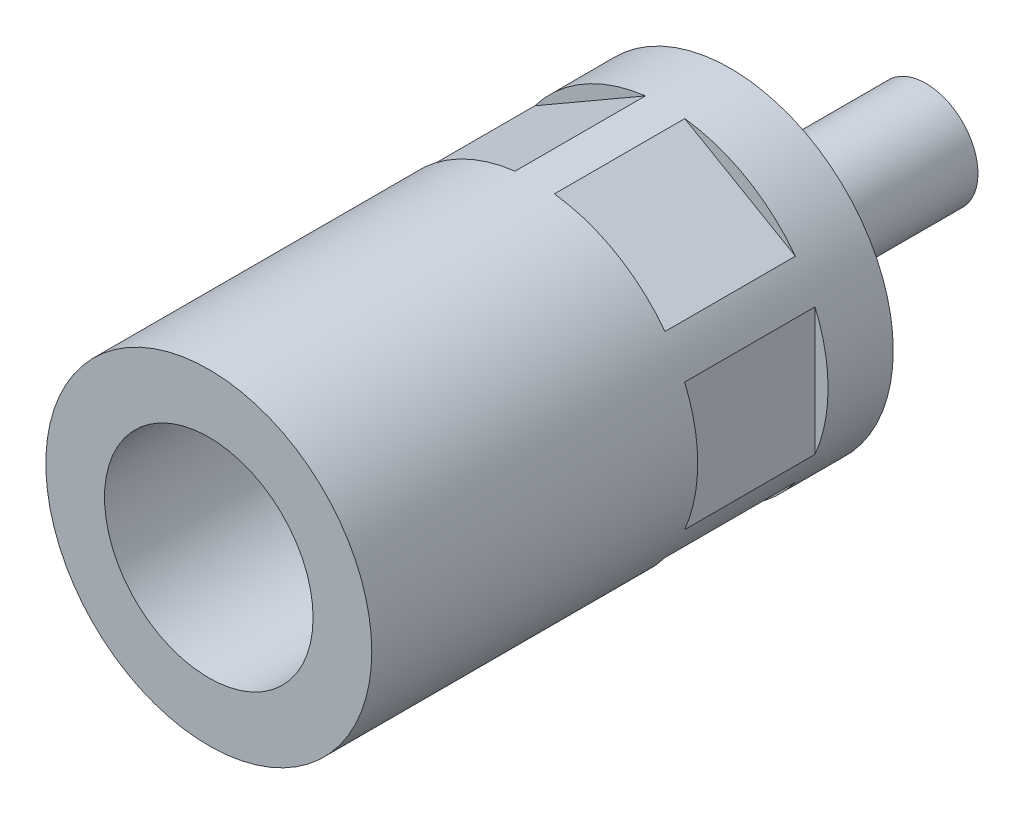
ISO-10303-21;
HEADER;
FILE_DESCRIPTION(('STEP AP214'),'2;1');
FILE_NAME('part.step','',(''),(''),'','','');
FILE_SCHEMA(('AUTOMOTIVE_DESIGN { 1 0 10303 214 1 1 1 1 }'));
ENDSEC;
DATA;
#1=APPLICATION_CONTEXT('core data for automotive mechanical design processes');
#2=APPLICATION_PROTOCOL_DEFINITION('international standard','automotive_design',2000,#1);
#3=PRODUCT_CONTEXT('',#1,'mechanical');
#4=PRODUCT('Part','Part','',(#3));
#5=PRODUCT_RELATED_PRODUCT_CATEGORY('part','',(#4));
#6=PRODUCT_DEFINITION_FORMATION('','',#4);
#7=PRODUCT_DEFINITION_CONTEXT('part definition',#1,'design');
#8=PRODUCT_DEFINITION('design','',#6,#7);
#9=PRODUCT_DEFINITION_SHAPE('','',#8);
#10=(LENGTH_UNIT() NAMED_UNIT(*) SI_UNIT(.MILLI.,.METRE.));
#11=(NAMED_UNIT(*) PLANE_ANGLE_UNIT() SI_UNIT($,.RADIAN.));
#12=(NAMED_UNIT(*) SI_UNIT($,.STERADIAN.) SOLID_ANGLE_UNIT());
#13=UNCERTAINTY_MEASURE_WITH_UNIT(LENGTH_MEASURE(1.E-05),#10,'distance_accuracy_value','');
#14=(GEOMETRIC_REPRESENTATION_CONTEXT(3) GLOBAL_UNCERTAINTY_ASSIGNED_CONTEXT((#13)) GLOBAL_UNIT_ASSIGNED_CONTEXT((#10,
#11,#12)) REPRESENTATION_CONTEXT('',''));
#15=CARTESIAN_POINT('',(0.,0.,0.));
#16=DIRECTION('',(0.,0.,1.));
#17=DIRECTION('',(1.,0.,0.));
#18=AXIS2_PLACEMENT_3D('',#15,#16,#17);
#19=CARTESIAN_POINT('',(0.,0.,80.));
#20=DIRECTION('',(0.,0.,1.));
#21=DIRECTION('',(1.,0.,0.));
#22=AXIS2_PLACEMENT_3D('',#19,#20,#21);
#23=CYLINDRICAL_SURFACE('',#22,25.);
#24=CARTESIAN_POINT('',(0.,0.,10.));
#25=DIRECTION('',(0.,0.,1.));
#26=DIRECTION('',(1.,0.,0.));
#27=AXIS2_PLACEMENT_3D('',#24,#25,#26);
#28=CIRCLE('',#27,25.);
#29=CARTESIAN_POINT('',(-19.9852813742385,-15.0196048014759,10.));
#30=VERTEX_POINT('',#29);
#31=CARTESIAN_POINT('',(-3.01471862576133,-24.8175637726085,10.));
#32=VERTEX_POINT('',#31);
#33=EDGE_CURVE('E153',#30,#32,#28,.T.);
#34=ORIENTED_EDGE('',*,*,#33,.F.);
#35=DIRECTION('',(0.,0.,1.));
#36=VECTOR('',#35,1.);
#37=CARTESIAN_POINT('',(-19.9852813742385,-15.0196048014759,80.));
#38=LINE('',#37,#36);
#39=CARTESIAN_POINT('',(-19.9852813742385,-15.0196048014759,30.));
#40=VERTEX_POINT('',#39);
#41=EDGE_CURVE('E9',#30,#40,#38,.T.);
#42=ORIENTED_EDGE('',*,*,#41,.T.);
#43=CARTESIAN_POINT('',(0.,0.,30.));
#44=DIRECTION('',(0.,0.,1.));
#45=DIRECTION('',(1.,0.,0.));
#46=AXIS2_PLACEMENT_3D('',#43,#44,#45);
#47=CIRCLE('',#46,25.);
#48=CARTESIAN_POINT('',(-3.01471862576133,-24.8175637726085,30.));
#49=VERTEX_POINT('',#48);
#50=EDGE_CURVE('E22',#40,#49,#47,.T.);
#51=ORIENTED_EDGE('',*,*,#50,.T.);
#52=DIRECTION('',(0.,0.,1.));
#53=VECTOR('',#52,1.);
#54=CARTESIAN_POINT('',(-3.01471862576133,-24.8175637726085,80.));
#55=LINE('',#54,#53);
#56=EDGE_CURVE('E150',#49,#32,#55,.F.);
#57=ORIENTED_EDGE('',*,*,#56,.T.);
#58=EDGE_LOOP('',(#34,#42,#51,#57));
#59=FACE_BOUND('',#58,.T.);
#60=DIRECTION('',(0.,0.,1.));
#61=VECTOR('',#60,1.);
#62=CARTESIAN_POINT('',(23.,9.79795897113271,80.));
#63=LINE('',#62,#61);
#64=CARTESIAN_POINT('',(23.,9.79795897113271,10.));
#65=VERTEX_POINT('',#64);
#66=CARTESIAN_POINT('',(23.,9.79795897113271,30.));
#67=VERTEX_POINT('',#66);
#68=EDGE_CURVE('E143',#65,#67,#63,.T.);
#69=ORIENTED_EDGE('',*,*,#68,.F.);
#70=CARTESIAN_POINT('',(23.,-9.79795897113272,10.));
#71=VERTEX_POINT('',#70);
#72=EDGE_CURVE('E142',#71,#65,#28,.T.);
#73=ORIENTED_EDGE('',*,*,#72,.F.);
#74=DIRECTION('',(0.,0.,1.));
#75=VECTOR('',#74,1.);
#76=CARTESIAN_POINT('',(23.,-9.79795897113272,80.));
#77=LINE('',#76,#75);
#78=CARTESIAN_POINT('',(23.,-9.79795897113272,30.));
#79=VERTEX_POINT('',#78);
#80=EDGE_CURVE('E139',#79,#71,#77,.F.);
#81=ORIENTED_EDGE('',*,*,#80,.F.);
#82=EDGE_CURVE('E146',#79,#67,#47,.T.);
#83=ORIENTED_EDGE('',*,*,#82,.T.);
#84=EDGE_LOOP('',(#69,#73,#81,#83));
#85=FACE_BOUND('',#84,.T.);
#86=CARTESIAN_POINT('',(19.9852813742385,15.0196048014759,10.));
#87=VERTEX_POINT('',#86);
#88=CARTESIAN_POINT('',(3.01471862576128,24.8175637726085,10.));
#89=VERTEX_POINT('',#88);
#90=EDGE_CURVE('E135',#87,#89,#28,.T.);
#91=ORIENTED_EDGE('',*,*,#90,.F.);
#92=DIRECTION('',(0.,0.,1.));
#93=VECTOR('',#92,1.);
#94=CARTESIAN_POINT('',(19.9852813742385,15.0196048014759,80.));
#95=LINE('',#94,#93);
#96=CARTESIAN_POINT('',(19.9852813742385,15.0196048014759,30.));
#97=VERTEX_POINT('',#96);
#98=EDGE_CURVE('E136',#87,#97,#95,.T.);
#99=ORIENTED_EDGE('',*,*,#98,.T.);
#100=CARTESIAN_POINT('',(3.01471862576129,24.8175637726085,30.));
#101=VERTEX_POINT('',#100);
#102=EDGE_CURVE('E140',#97,#101,#47,.T.);
#103=ORIENTED_EDGE('',*,*,#102,.T.);
#104=DIRECTION('',(0.,0.,1.));
#105=VECTOR('',#104,1.);
#106=CARTESIAN_POINT('',(3.01471862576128,24.8175637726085,80.));
#107=LINE('',#106,#105);
#108=EDGE_CURVE('E132',#101,#89,#107,.F.);
#109=ORIENTED_EDGE('',*,*,#108,.T.);
#110=EDGE_LOOP('',(#91,#99,#103,#109));
#111=FACE_BOUND('',#110,.T.);
#112=CARTESIAN_POINT('',(0.,0.,0.));
#113=DIRECTION('',(0.,0.,1.));
#114=DIRECTION('',(1.,0.,0.));
#115=AXIS2_PLACEMENT_3D('',#112,#113,#114);
#116=CIRCLE('',#115,25.);
#117=CARTESIAN_POINT('',(25.,0.,0.));
#118=VERTEX_POINT('',#117);
#119=EDGE_CURVE('E202',#118,#118,#116,.T.);
#120=ORIENTED_EDGE('',*,*,#119,.T.);
#121=EDGE_LOOP('',(#120));
#122=FACE_BOUND('',#121,.T.);
#123=CARTESIAN_POINT('',(0.,0.,80.));
#124=DIRECTION('',(0.,0.,1.));
#125=DIRECTION('',(1.,0.,0.));
#126=AXIS2_PLACEMENT_3D('',#123,#124,#125);
#127=CIRCLE('',#126,25.);
#128=CARTESIAN_POINT('',(25.,0.,80.));
#129=VERTEX_POINT('',#128);
#130=EDGE_CURVE('E205',#129,#129,#127,.T.);
#131=ORIENTED_EDGE('',*,*,#130,.F.);
#132=EDGE_LOOP('',(#131));
#133=FACE_BOUND('',#132,.T.);
#134=CARTESIAN_POINT('',(-23.,9.79795897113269,10.));
#135=VERTEX_POINT('',#134);
#136=CARTESIAN_POINT('',(-23.,-9.79795897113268,10.));
#137=VERTEX_POINT('',#136);
#138=EDGE_CURVE('E111',#135,#137,#28,.T.);
#139=ORIENTED_EDGE('',*,*,#138,.F.);
#140=DIRECTION('',(0.,0.,1.));
#141=VECTOR('',#140,1.);
#142=CARTESIAN_POINT('',(-23.,9.79795897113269,80.));
#143=LINE('',#142,#141);
#144=CARTESIAN_POINT('',(-23.,9.79795897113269,30.));
#145=VERTEX_POINT('',#144);
#146=EDGE_CURVE('E110',#135,#145,#143,.T.);
#147=ORIENTED_EDGE('',*,*,#146,.T.);
#148=CARTESIAN_POINT('',(-23.,-9.79795897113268,30.));
#149=VERTEX_POINT('',#148);
#150=EDGE_CURVE('E103',#145,#149,#47,.T.);
#151=ORIENTED_EDGE('',*,*,#150,.T.);
#152=DIRECTION('',(0.,0.,1.));
#153=VECTOR('',#152,1.);
#154=CARTESIAN_POINT('',(-23.,-9.79795897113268,80.));
#155=LINE('',#154,#153);
#156=EDGE_CURVE('E117',#149,#137,#155,.F.);
#157=ORIENTED_EDGE('',*,*,#156,.T.);
#158=EDGE_LOOP('',(#139,#147,#151,#157));
#159=FACE_BOUND('',#158,.T.);
#160=DIRECTION('',(0.,0.,1.));
#161=VECTOR('',#160,1.);
#162=CARTESIAN_POINT('',(-19.9852813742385,15.0196048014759,80.));
#163=LINE('',#162,#161);
#164=CARTESIAN_POINT('',(-19.9852813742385,15.0196048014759,10.));
#165=VERTEX_POINT('',#164);
#166=CARTESIAN_POINT('',(-19.9852813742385,15.0196048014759,30.));
#167=VERTEX_POINT('',#166);
#168=EDGE_CURVE('E130',#165,#167,#163,.T.);
#169=ORIENTED_EDGE('',*,*,#168,.F.);
#170=CARTESIAN_POINT('',(-3.0147186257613,24.8175637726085,10.));
#171=VERTEX_POINT('',#170);
#172=EDGE_CURVE('E126',#171,#165,#28,.T.);
#173=ORIENTED_EDGE('',*,*,#172,.F.);
#174=DIRECTION('',(0.,0.,1.));
#175=VECTOR('',#174,1.);
#176=CARTESIAN_POINT('',(-3.0147186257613,24.8175637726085,80.));
#177=LINE('',#176,#175);
#178=CARTESIAN_POINT('',(-3.0147186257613,24.8175637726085,30.));
#179=VERTEX_POINT('',#178);
#180=EDGE_CURVE('E124',#179,#171,#177,.F.);
#181=ORIENTED_EDGE('',*,*,#180,.F.);
#182=EDGE_CURVE('E113',#179,#167,#47,.T.);
#183=ORIENTED_EDGE('',*,*,#182,.T.);
#184=EDGE_LOOP('',(#169,#173,#181,#183));
#185=FACE_BOUND('',#184,.T.);
#186=DIRECTION('',(0.,0.,1.));
#187=VECTOR('',#186,1.);
#188=CARTESIAN_POINT('',(19.9852813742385,-15.0196048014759,80.));
#189=LINE('',#188,#187);
#190=CARTESIAN_POINT('',(19.9852813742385,-15.0196048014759,10.));
#191=VERTEX_POINT('',#190);
#192=CARTESIAN_POINT('',(19.9852813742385,-15.0196048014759,30.));
#193=VERTEX_POINT('',#192);
#194=EDGE_CURVE('E149',#191,#193,#189,.T.);
#195=ORIENTED_EDGE('',*,*,#194,.F.);
#196=CARTESIAN_POINT('',(3.01471862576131,-24.8175637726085,10.));
#197=VERTEX_POINT('',#196);
#198=EDGE_CURVE('E148',#197,#191,#28,.T.);
#199=ORIENTED_EDGE('',*,*,#198,.F.);
#200=DIRECTION('',(0.,0.,1.));
#201=VECTOR('',#200,1.);
#202=CARTESIAN_POINT('',(3.01471862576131,-24.8175637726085,80.));
#203=LINE('',#202,#201);
#204=CARTESIAN_POINT('',(3.01471862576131,-24.8175637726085,30.));
#205=VERTEX_POINT('',#204);
#206=EDGE_CURVE('E145',#205,#197,#203,.F.);
#207=ORIENTED_EDGE('',*,*,#206,.F.);
#208=EDGE_CURVE('E151',#205,#193,#47,.T.);
#209=ORIENTED_EDGE('',*,*,#208,.T.);
#210=EDGE_LOOP('',(#195,#199,#207,#209));
#211=FACE_BOUND('',#210,.T.);
#212=ADVANCED_FACE('F14',(#59,#85,#111,#122,#133,#159,#185,#211),#23,.T.);
#213=CARTESIAN_POINT('',(0.,0.,-30.));
#214=DIRECTION('',(0.,0.,1.));
#215=DIRECTION('',(1.,0.,0.));
#216=AXIS2_PLACEMENT_3D('',#213,#214,#215);
#217=PLANE('',#216);
#218=CARTESIAN_POINT('',(0.,0.,-30.));
#219=DIRECTION('',(0.,0.,1.));
#220=DIRECTION('',(1.,0.,0.));
#221=AXIS2_PLACEMENT_3D('',#218,#219,#220);
#222=CIRCLE('',#221,8.);
#223=CARTESIAN_POINT('',(8.,0.,-30.));
#224=VERTEX_POINT('',#223);
#225=EDGE_CURVE('E118',#224,#224,#222,.T.);
#226=ORIENTED_EDGE('',*,*,#225,.F.);
#227=EDGE_LOOP('',(#226));
#228=FACE_BOUND('',#227,.T.);
#229=ADVANCED_FACE('F16',(#228),#217,.F.);
#230=CARTESIAN_POINT('',(8.,0.,11.));
#231=DIRECTION('',(0.,0.,-1.));
#232=DIRECTION('',(-1.,0.,0.));
#233=AXIS2_PLACEMENT_3D('',#230,#231,#232);
#234=PLANE('',#233);
#235=CARTESIAN_POINT('',(0.,0.,11.));
#236=DIRECTION('',(0.,0.,1.));
#237=DIRECTION('',(1.,0.,0.));
#238=AXIS2_PLACEMENT_3D('',#235,#236,#237);
#239=CIRCLE('',#238,8.);
#240=CARTESIAN_POINT('',(8.,0.,11.));
#241=VERTEX_POINT('',#240);
#242=EDGE_CURVE('E160',#241,#241,#239,.T.);
#243=ORIENTED_EDGE('',*,*,#242,.T.);
#244=EDGE_LOOP('',(#243));
#245=FACE_BOUND('',#244,.T.);
#246=ADVANCED_FACE('F220',(#245),#234,.F.);
#247=CARTESIAN_POINT('',(0.,0.,80.));
#248=DIRECTION('',(0.,0.,1.));
#249=DIRECTION('',(1.,0.,0.));
#250=AXIS2_PLACEMENT_3D('',#247,#248,#249);
#251=CYLINDRICAL_SURFACE('',#250,8.);
#252=ORIENTED_EDGE('',*,*,#242,.F.);
#253=EDGE_LOOP('',(#252));
#254=FACE_BOUND('',#253,.T.);
#255=CARTESIAN_POINT('',(0.,0.,40.));
#256=DIRECTION('',(0.,0.,1.));
#257=DIRECTION('',(1.,0.,0.));
#258=AXIS2_PLACEMENT_3D('',#255,#256,#257);
#259=CIRCLE('',#258,8.);
#260=CARTESIAN_POINT('',(8.,0.,40.));
#261=VERTEX_POINT('',#260);
#262=EDGE_CURVE('E214',#261,#261,#259,.T.);
#263=ORIENTED_EDGE('',*,*,#262,.T.);
#264=EDGE_LOOP('',(#263));
#265=FACE_BOUND('',#264,.T.);
#266=ADVANCED_FACE('F222',(#254,#265),#251,.F.);
#267=CARTESIAN_POINT('',(8.,0.,40.));
#268=DIRECTION('',(0.,0.,1.));
#269=DIRECTION('',(1.,0.,0.));
#270=AXIS2_PLACEMENT_3D('',#267,#268,#269);
#271=PLANE('',#270);
#272=CARTESIAN_POINT('',(0.,0.,40.));
#273=DIRECTION('',(0.,0.,1.));
#274=DIRECTION('',(1.,0.,0.));
#275=AXIS2_PLACEMENT_3D('',#272,#273,#274);
#276=CIRCLE('',#275,16.);
#277=CARTESIAN_POINT('',(16.,0.,40.));
#278=VERTEX_POINT('',#277);
#279=EDGE_CURVE('E211',#278,#278,#276,.T.);
#280=ORIENTED_EDGE('',*,*,#279,.T.);
#281=EDGE_LOOP('',(#280));
#282=FACE_BOUND('',#281,.T.);
#283=ORIENTED_EDGE('',*,*,#262,.F.);
#284=EDGE_LOOP('',(#283));
#285=FACE_BOUND('',#284,.T.);
#286=ADVANCED_FACE('F225',(#282,#285),#271,.T.);
#287=CARTESIAN_POINT('',(0.,0.,80.));
#288=DIRECTION('',(0.,0.,1.));
#289=DIRECTION('',(1.,0.,0.));
#290=AXIS2_PLACEMENT_3D('',#287,#288,#289);
#291=CYLINDRICAL_SURFACE('',#290,16.);
#292=ORIENTED_EDGE('',*,*,#279,.F.);
#293=EDGE_LOOP('',(#292));
#294=FACE_BOUND('',#293,.T.);
#295=CARTESIAN_POINT('',(0.,0.,80.));
#296=DIRECTION('',(0.,0.,1.));
#297=DIRECTION('',(1.,0.,0.));
#298=AXIS2_PLACEMENT_3D('',#295,#296,#297);
#299=CIRCLE('',#298,16.);
#300=CARTESIAN_POINT('',(16.,0.,80.));
#301=VERTEX_POINT('',#300);
#302=EDGE_CURVE('E208',#301,#301,#299,.T.);
#303=ORIENTED_EDGE('',*,*,#302,.T.);
#304=EDGE_LOOP('',(#303));
#305=FACE_BOUND('',#304,.T.);
#306=ADVANCED_FACE('F230',(#294,#305),#291,.F.);
#307=CARTESIAN_POINT('',(25.,0.,80.));
#308=DIRECTION('',(0.,0.,-1.));
#309=DIRECTION('',(-1.,0.,0.));
#310=AXIS2_PLACEMENT_3D('',#307,#308,#309);
#311=PLANE('',#310);
#312=ORIENTED_EDGE('',*,*,#302,.F.);
#313=EDGE_LOOP('',(#312));
#314=FACE_BOUND('',#313,.T.);
#315=ORIENTED_EDGE('',*,*,#130,.T.);
#316=EDGE_LOOP('',(#315));
#317=FACE_BOUND('',#316,.T.);
#318=ADVANCED_FACE('F238',(#314,#317),#311,.F.);
#319=CARTESIAN_POINT('',(25.,0.,0.));
#320=DIRECTION('',(0.,0.,-1.));
#321=DIRECTION('',(-1.,0.,0.));
#322=AXIS2_PLACEMENT_3D('',#319,#320,#321);
#323=PLANE('',#322);
#324=CARTESIAN_POINT('',(0.,0.,0.));
#325=DIRECTION('',(0.,0.,1.));
#326=DIRECTION('',(1.,0.,0.));
#327=AXIS2_PLACEMENT_3D('',#324,#325,#326);
#328=CIRCLE('',#327,8.);
#329=CARTESIAN_POINT('',(8.,0.,0.));
#330=VERTEX_POINT('',#329);
#331=EDGE_CURVE('E199',#330,#330,#328,.T.);
#332=ORIENTED_EDGE('',*,*,#331,.T.);
#333=EDGE_LOOP('',(#332));
#334=FACE_BOUND('',#333,.T.);
#335=ORIENTED_EDGE('',*,*,#119,.F.);
#336=EDGE_LOOP('',(#335));
#337=FACE_BOUND('',#336,.T.);
#338=ADVANCED_FACE('F250',(#334,#337),#323,.T.);
#339=CARTESIAN_POINT('',(0.,0.,80.));
#340=DIRECTION('',(0.,0.,1.));
#341=DIRECTION('',(1.,0.,0.));
#342=AXIS2_PLACEMENT_3D('',#339,#340,#341);
#343=CYLINDRICAL_SURFACE('',#342,8.);
#344=ORIENTED_EDGE('',*,*,#331,.F.);
#345=EDGE_LOOP('',(#344));
#346=FACE_BOUND('',#345,.T.);
#347=ORIENTED_EDGE('',*,*,#225,.T.);
#348=EDGE_LOOP('',(#347));
#349=FACE_BOUND('',#348,.T.);
#350=ADVANCED_FACE('F258',(#346,#349),#343,.T.);
#351=CARTESIAN_POINT('',(-23.,13.2790561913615,30.));
#352=DIRECTION('',(1.,0.,0.));
#353=DIRECTION('',(0.,1.,0.));
#354=AXIS2_PLACEMENT_3D('',#351,#352,#353);
#355=PLANE('',#354);
#356=DIRECTION('',(0.,-1.,0.));
#357=VECTOR('',#356,1.);
#358=CARTESIAN_POINT('',(-23.,13.2790561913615,10.));
#359=LINE('',#358,#357);
#360=EDGE_CURVE('E193',#135,#137,#359,.T.);
#361=ORIENTED_EDGE('',*,*,#360,.T.);
#362=ORIENTED_EDGE('',*,*,#156,.F.);
#363=DIRECTION('',(0.,-1.,0.));
#364=VECTOR('',#363,1.);
#365=CARTESIAN_POINT('',(-23.,13.2790561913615,30.));
#366=LINE('',#365,#364);
#367=EDGE_CURVE('E106',#145,#149,#366,.T.);
#368=ORIENTED_EDGE('',*,*,#367,.F.);
#369=ORIENTED_EDGE('',*,*,#146,.F.);
#370=EDGE_LOOP('',(#361,#362,#368,#369));
#371=FACE_BOUND('',#370,.T.);
#372=ADVANCED_FACE('F115',(#371),#355,.F.);
#373=CARTESIAN_POINT('',(0.,0.,10.));
#374=DIRECTION('',(0.,0.,1.));
#375=DIRECTION('',(1.,0.,0.));
#376=AXIS2_PLACEMENT_3D('',#373,#374,#375);
#377=PLANE('',#376);
#378=ORIENTED_EDGE('',*,*,#138,.T.);
#379=ORIENTED_EDGE('',*,*,#360,.F.);
#380=EDGE_LOOP('',(#378,#379));
#381=FACE_BOUND('',#380,.T.);
#382=ADVANCED_FACE('F280',(#381),#377,.T.);
#383=CARTESIAN_POINT('',(0.,0.,30.));
#384=DIRECTION('',(0.,0.,1.));
#385=DIRECTION('',(1.,0.,0.));
#386=AXIS2_PLACEMENT_3D('',#383,#384,#385);
#387=PLANE('',#386);
#388=ORIENTED_EDGE('',*,*,#367,.T.);
#389=ORIENTED_EDGE('',*,*,#150,.F.);
#390=EDGE_LOOP('',(#388,#389));
#391=FACE_BOUND('',#390,.T.);
#392=ADVANCED_FACE('F105',(#391),#387,.F.);
#393=CARTESIAN_POINT('',(-23.,13.2790561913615,30.));
#394=DIRECTION('',(-0.5,0.866025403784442,0.));
#395=DIRECTION('',(-0.866025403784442,-0.5,0.));
#396=AXIS2_PLACEMENT_3D('',#393,#394,#395);
#397=PLANE('',#396);
#398=ORIENTED_EDGE('',*,*,#168,.T.);
#399=DIRECTION('',(0.866025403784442,0.5,0.));
#400=VECTOR('',#399,1.);
#401=CARTESIAN_POINT('',(-23.,13.2790561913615,30.));
#402=LINE('',#401,#400);
#403=EDGE_CURVE('E119',#167,#179,#402,.T.);
#404=ORIENTED_EDGE('',*,*,#403,.T.);
#405=ORIENTED_EDGE('',*,*,#180,.T.);
#406=DIRECTION('',(0.866025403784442,0.5,0.));
#407=VECTOR('',#406,1.);
#408=CARTESIAN_POINT('',(-23.,13.2790561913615,10.));
#409=LINE('',#408,#407);
#410=EDGE_CURVE('E344',#165,#171,#409,.T.);
#411=ORIENTED_EDGE('',*,*,#410,.F.);
#412=EDGE_LOOP('',(#398,#404,#405,#411));
#413=FACE_BOUND('',#412,.T.);
#414=ADVANCED_FACE('F306',(#413),#397,.T.);
#415=ORIENTED_EDGE('',*,*,#172,.T.);
#416=ORIENTED_EDGE('',*,*,#410,.T.);
#417=EDGE_LOOP('',(#415,#416));
#418=FACE_BOUND('',#417,.T.);
#419=ADVANCED_FACE('F294',(#418),#377,.T.);
#420=ORIENTED_EDGE('',*,*,#403,.F.);
#421=ORIENTED_EDGE('',*,*,#182,.F.);
#422=EDGE_LOOP('',(#420,#421));
#423=FACE_BOUND('',#422,.T.);
#424=ADVANCED_FACE('F289',(#423),#387,.F.);
#425=CARTESIAN_POINT('',(23.,13.2790561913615,30.));
#426=DIRECTION('',(-0.499999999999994,-0.866025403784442,0.));
#427=DIRECTION('',(0.866025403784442,-0.499999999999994,0.));
#428=AXIS2_PLACEMENT_3D('',#425,#426,#427);
#429=PLANE('',#428);
#430=DIRECTION('',(-0.866025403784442,0.499999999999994,0.));
#431=VECTOR('',#430,1.);
#432=CARTESIAN_POINT('',(23.,13.2790561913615,10.));
#433=LINE('',#432,#431);
#434=EDGE_CURVE('E345',#87,#89,#433,.T.);
#435=ORIENTED_EDGE('',*,*,#434,.T.);
#436=ORIENTED_EDGE('',*,*,#108,.F.);
#437=DIRECTION('',(-0.866025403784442,0.499999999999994,0.));
#438=VECTOR('',#437,1.);
#439=CARTESIAN_POINT('',(23.,13.2790561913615,30.));
#440=LINE('',#439,#438);
#441=EDGE_CURVE('E190',#97,#101,#440,.T.);
#442=ORIENTED_EDGE('',*,*,#441,.F.);
#443=ORIENTED_EDGE('',*,*,#98,.F.);
#444=EDGE_LOOP('',(#435,#436,#442,#443));
#445=FACE_BOUND('',#444,.T.);
#446=ADVANCED_FACE('F293',(#445),#429,.F.);
#447=ORIENTED_EDGE('',*,*,#90,.T.);
#448=ORIENTED_EDGE('',*,*,#434,.F.);
#449=EDGE_LOOP('',(#447,#448));
#450=FACE_BOUND('',#449,.T.);
#451=ADVANCED_FACE('F287',(#450),#377,.T.);
#452=ORIENTED_EDGE('',*,*,#441,.T.);
#453=ORIENTED_EDGE('',*,*,#102,.F.);
#454=EDGE_LOOP('',(#452,#453));
#455=FACE_BOUND('',#454,.T.);
#456=ADVANCED_FACE('F283',(#455),#387,.F.);
#457=CARTESIAN_POINT('',(23.,13.2790561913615,30.));
#458=DIRECTION('',(1.,0.,0.));
#459=DIRECTION('',(0.,1.,0.));
#460=AXIS2_PLACEMENT_3D('',#457,#458,#459);
#461=PLANE('',#460);
#462=ORIENTED_EDGE('',*,*,#68,.T.);
#463=DIRECTION('',(0.,-1.,0.));
#464=VECTOR('',#463,1.);
#465=CARTESIAN_POINT('',(23.,13.2790561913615,30.));
#466=LINE('',#465,#464);
#467=EDGE_CURVE('E187',#67,#79,#466,.T.);
#468=ORIENTED_EDGE('',*,*,#467,.T.);
#469=ORIENTED_EDGE('',*,*,#80,.T.);
#470=DIRECTION('',(0.,-1.,0.));
#471=VECTOR('',#470,1.);
#472=CARTESIAN_POINT('',(23.,13.2790561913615,10.));
#473=LINE('',#472,#471);
#474=EDGE_CURVE('E348',#65,#71,#473,.T.);
#475=ORIENTED_EDGE('',*,*,#474,.F.);
#476=EDGE_LOOP('',(#462,#468,#469,#475));
#477=FACE_BOUND('',#476,.T.);
#478=ADVANCED_FACE('F286',(#477),#461,.T.);
#479=ORIENTED_EDGE('',*,*,#72,.T.);
#480=ORIENTED_EDGE('',*,*,#474,.T.);
#481=EDGE_LOOP('',(#479,#480));
#482=FACE_BOUND('',#481,.T.);
#483=ADVANCED_FACE('F295',(#482),#377,.T.);
#484=ORIENTED_EDGE('',*,*,#467,.F.);
#485=ORIENTED_EDGE('',*,*,#82,.F.);
#486=EDGE_LOOP('',(#484,#485));
#487=FACE_BOUND('',#486,.T.);
#488=ADVANCED_FACE('F290',(#487),#387,.F.);
#489=CARTESIAN_POINT('',(23.,-13.2790561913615,30.));
#490=DIRECTION('',(0.5,-0.866025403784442,0.));
#491=DIRECTION('',(0.866025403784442,0.5,0.));
#492=AXIS2_PLACEMENT_3D('',#489,#490,#491);
#493=PLANE('',#492);
#494=ORIENTED_EDGE('',*,*,#194,.T.);
#495=DIRECTION('',(-0.866025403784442,-0.5,0.));
#496=VECTOR('',#495,1.);
#497=CARTESIAN_POINT('',(23.,-13.2790561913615,30.));
#498=LINE('',#497,#496);
#499=EDGE_CURVE('E37',#193,#205,#498,.T.);
#500=ORIENTED_EDGE('',*,*,#499,.T.);
#501=ORIENTED_EDGE('',*,*,#206,.T.);
#502=DIRECTION('',(-0.866025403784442,-0.5,0.));
#503=VECTOR('',#502,1.);
#504=CARTESIAN_POINT('',(23.,-13.2790561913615,10.));
#505=LINE('',#504,#503);
#506=EDGE_CURVE('E352',#191,#197,#505,.T.);
#507=ORIENTED_EDGE('',*,*,#506,.F.);
#508=EDGE_LOOP('',(#494,#500,#501,#507));
#509=FACE_BOUND('',#508,.T.);
#510=ADVANCED_FACE('F296',(#509),#493,.T.);
#511=ORIENTED_EDGE('',*,*,#198,.T.);
#512=ORIENTED_EDGE('',*,*,#506,.T.);
#513=EDGE_LOOP('',(#511,#512));
#514=FACE_BOUND('',#513,.T.);
#515=ADVANCED_FACE('F299',(#514),#377,.T.);
#516=ORIENTED_EDGE('',*,*,#499,.F.);
#517=ORIENTED_EDGE('',*,*,#208,.F.);
#518=EDGE_LOOP('',(#516,#517));
#519=FACE_BOUND('',#518,.T.);
#520=ADVANCED_FACE('F186',(#519),#387,.F.);
#521=DIRECTION('',(0.866025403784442,-0.5,0.));
#522=VECTOR('',#521,1.);
#523=CARTESIAN_POINT('',(-23.,-13.2790561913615,30.));
#524=LINE('',#523,#522);
#525=EDGE_CURVE('E188',#40,#49,#524,.T.);
#526=ORIENTED_EDGE('',*,*,#525,.T.);
#527=ORIENTED_EDGE('',*,*,#50,.F.);
#528=EDGE_LOOP('',(#526,#527));
#529=FACE_BOUND('',#528,.T.);
#530=ADVANCED_FACE('F317',(#529),#387,.F.);
#531=ORIENTED_EDGE('',*,*,#33,.T.);
#532=DIRECTION('',(0.866025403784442,-0.5,0.));
#533=VECTOR('',#532,1.);
#534=CARTESIAN_POINT('',(-23.,-13.2790561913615,10.));
#535=LINE('',#534,#533);
#536=EDGE_CURVE('E29',#30,#32,#535,.T.);
#537=ORIENTED_EDGE('',*,*,#536,.F.);
#538=EDGE_LOOP('',(#531,#537));
#539=FACE_BOUND('',#538,.T.);
#540=ADVANCED_FACE('F312',(#539),#377,.T.);
#541=CARTESIAN_POINT('',(-23.,-13.2790561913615,30.));
#542=DIRECTION('',(0.5,0.866025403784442,0.));
#543=DIRECTION('',(-0.866025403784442,0.5,0.));
#544=AXIS2_PLACEMENT_3D('',#541,#542,#543);
#545=PLANE('',#544);
#546=ORIENTED_EDGE('',*,*,#536,.T.);
#547=ORIENTED_EDGE('',*,*,#56,.F.);
#548=ORIENTED_EDGE('',*,*,#525,.F.);
#549=ORIENTED_EDGE('',*,*,#41,.F.);
#550=EDGE_LOOP('',(#546,#547,#548,#549));
#551=FACE_BOUND('',#550,.T.);
#552=ADVANCED_FACE('F310',(#551),#545,.F.);
#553=CLOSED_SHELL('',(#212,#229,#246,#266,#286,#306,#318,#338,#350,#372,#382,#392,#414,#419,
#424,#446,#451,#456,#478,#483,#488,#510,#515,#520,#530,#540,#552));
#554=MANIFOLD_SOLID_BREP('B1',#553);
#555=ADVANCED_BREP_SHAPE_REPRESENTATION('',(#18,#554),#14);
#556=SHAPE_DEFINITION_REPRESENTATION(#9,#555);
ENDSEC;
END-ISO-10303-21;
